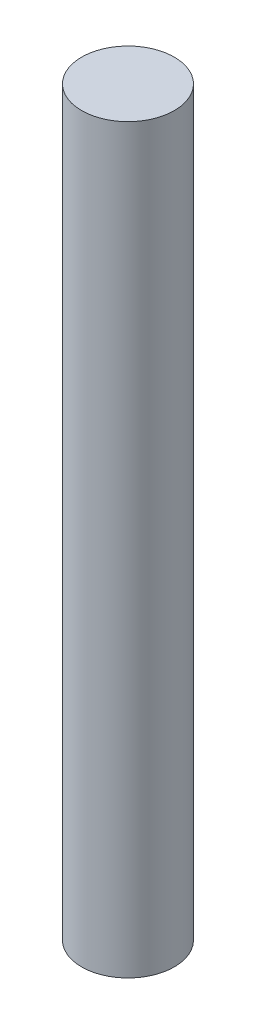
from build123d import *

# Parameters (mm, degrees)
SKETCH1_R           = 3.175
BOSS_EXTRUDE1_DEPTH = 50.8


with BuildPart() as part:
    # Sketch1 → Boss-Extrude1 (new body)
    with BuildSketch(Plane(origin=(0, 0, 0), x_dir=(1, 0, 0), z_dir=(0, 1, 0))):
        with Locations(Location((0, 0, 0), (0, 0, 270))):
            Circle(SKETCH1_R)
    extrude(amount=-BOSS_EXTRUDE1_DEPTH)


solid = part.part
